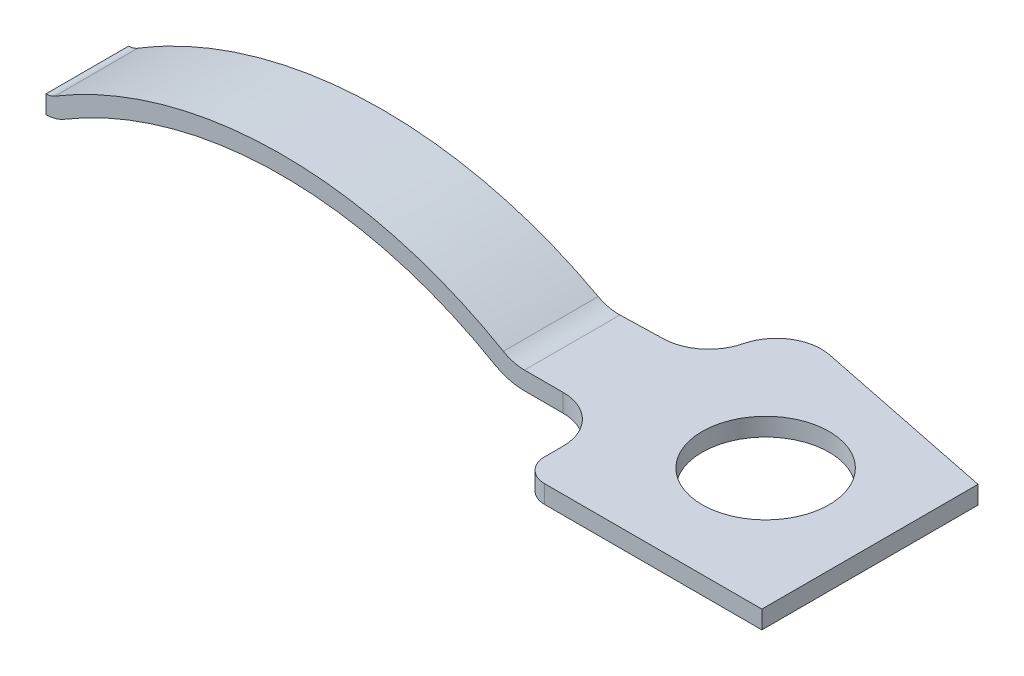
from build123d import *

# Parameters (mm, degrees)
BOSS_EXTRUDE3_DEPTH      = 4.191
BOSS_EXTRUDE3_DEPTH_BACK = 4.572
CUT_EXTRUDE4_DEPTH       = 24.665236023
CUT_EXTRUDE4_DEPTH_BACK  = 24.665236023
SKETCH6_R                = 2.1463
FILLET1_R                = 1.5748
FILLET2_R                = 0.7874


with BuildPart() as part:
    # Sketch1 → Boss-Extrude3 (new, two sides: drawn at the far end of the back side and taken through both)
    with BuildSketch(Plane.XY.offset(-BOSS_EXTRUDE3_DEPTH_BACK)):
        with BuildLine():
            Line((-6.942782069, 0), (4.064, 0))
            Line((4.064, 0), (4.064, 0.6096))
            Line((4.064, 0.6096), (-6.942782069, 0.6096))
            ThreePointArc((-6.942782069, 0.6096), (-7.312891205, 0.658595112), (-7.65750324, 0.802205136))
            ThreePointArc((-7.65750324, 0.802205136), (-15.250281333, 2.819013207), (-22.813204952, 0.692988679))
            ThreePointArc((-22.813204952, 0.692988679), (-22.957930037, 0.630833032), (-23.114, 0.6096))
            Line((-23.114, 0.6096), (-23.114, 0))
            ThreePointArc((-23.114, 0), (-22.795074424, 0.04338924), (-22.499331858, 0.170402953))
            ThreePointArc((-22.499331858, 0.170402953), (-15.24588849, 2.209429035), (-7.963812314, 0.275150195))
            ThreePointArc((-7.963812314, 0.275150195), (-7.471509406, 0.069993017), (-6.942782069, 0))
        make_face()
    extrude(amount=BOSS_EXTRUDE3_DEPTH + BOSS_EXTRUDE3_DEPTH_BACK)

    # Sketch6 → Cut-Extrude4 (cut, two sides: drawn at the far end of the back side and taken through both)
    with BuildSketch(Plane(origin=(0, 0.6096, 0), x_dir=(1, 0, 0), z_dir=(0, 1, 0)).offset(-CUT_EXTRUDE4_DEPTH_BACK)):
        with Locations(Location((0, 0, 0), (0, 0, 180))):
            Circle(SKETCH6_R)
        with BuildLine():
            Line((-4.064, 2.901441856), (-4.064, 2.0955))
            Line((-4.064, 2.0955), (-23.114, 1.5875))
            Line((-23.114, 1.5875), (-23.114, -1.2065))
            Line((-23.114, -1.2065), (-4.064, -1.2065))
            Line((-4.064, -1.2065), (-4.064, -4.445))
            Line((-4.064, -4.445), (-23.622, -4.445))
            Line((-23.622, -4.445), (-23.622, 5.334))
            Line((-23.622, 5.334), (4.064, 5.334))
            Line((4.064, 5.334), (4.064, 3.113064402))
            Line((4.064, 3.113064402), (-2.236163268, 4.394847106))
            ThreePointArc((-2.236163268, 4.394847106), (-3.504242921, 4.081616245), (-4.064, 2.901441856))
        make_face()
    extrude(amount=CUT_EXTRUDE4_DEPTH + CUT_EXTRUDE4_DEPTH_BACK, mode=Mode.SUBTRACT)

    # Fillet1
    fillet1_edges = [part.edges().sort_by_distance(p)[0] for p in [
        (-4.064, 0.3048, -2.0955),
        (-4.064, 0.3048, 1.2065),
    ]]
    fillet(fillet1_edges, radius=FILLET1_R)

    # Fillet2
    fillet2_edges = [part.edges().sort_by_distance(p)[0] for p in [
        (-4.064, 0.3048, 4.191),
    ]]
    fillet(fillet2_edges, radius=FILLET2_R)


solid = part.part
